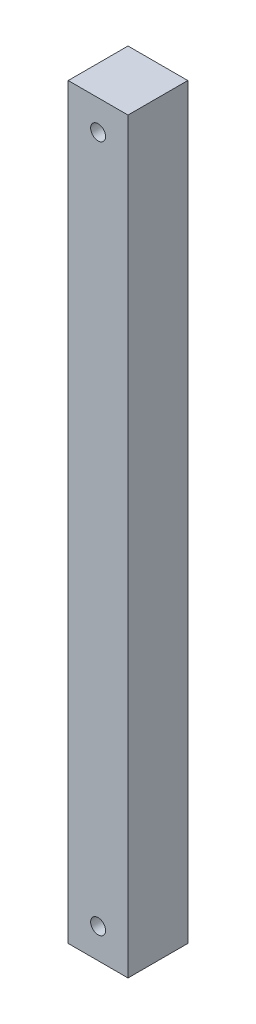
ISO-10303-21;
HEADER;
FILE_DESCRIPTION(('STEP AP214'),'2;1');
FILE_NAME('part.step','',(''),(''),'','','');
FILE_SCHEMA(('AUTOMOTIVE_DESIGN { 1 0 10303 214 1 1 1 1 }'));
ENDSEC;
DATA;
#1=APPLICATION_CONTEXT('core data for automotive mechanical design processes');
#2=APPLICATION_PROTOCOL_DEFINITION('international standard','automotive_design',2000,#1);
#3=PRODUCT_CONTEXT('',#1,'mechanical');
#4=PRODUCT('Part','Part','',(#3));
#5=PRODUCT_RELATED_PRODUCT_CATEGORY('part','',(#4));
#6=PRODUCT_DEFINITION_FORMATION('','',#4);
#7=PRODUCT_DEFINITION_CONTEXT('part definition',#1,'design');
#8=PRODUCT_DEFINITION('design','',#6,#7);
#9=PRODUCT_DEFINITION_SHAPE('','',#8);
#10=(LENGTH_UNIT() NAMED_UNIT(*) SI_UNIT(.MILLI.,.METRE.));
#11=(NAMED_UNIT(*) PLANE_ANGLE_UNIT() SI_UNIT($,.RADIAN.));
#12=(NAMED_UNIT(*) SI_UNIT($,.STERADIAN.) SOLID_ANGLE_UNIT());
#13=UNCERTAINTY_MEASURE_WITH_UNIT(LENGTH_MEASURE(1.E-05),#10,'distance_accuracy_value','');
#14=(GEOMETRIC_REPRESENTATION_CONTEXT(3) GLOBAL_UNCERTAINTY_ASSIGNED_CONTEXT((#13)) GLOBAL_UNIT_ASSIGNED_CONTEXT((#10,
#11,#12)) REPRESENTATION_CONTEXT('',''));
#15=CARTESIAN_POINT('',(0.,0.,0.));
#16=DIRECTION('',(0.,0.,1.));
#17=DIRECTION('',(1.,0.,0.));
#18=AXIS2_PLACEMENT_3D('',#15,#16,#17);
#19=CARTESIAN_POINT('',(0.,0.,2.));
#20=DIRECTION('',(0.,0.,1.));
#21=DIRECTION('',(1.,0.,0.));
#22=AXIS2_PLACEMENT_3D('',#19,#20,#21);
#23=PLANE('',#22);
#24=CARTESIAN_POINT('',(9.,24.,2.));
#25=DIRECTION('',(0.,0.,1.));
#26=DIRECTION('',(1.,0.,0.));
#27=AXIS2_PLACEMENT_3D('',#24,#25,#26);
#28=CIRCLE('',#27,0.25);
#29=CARTESIAN_POINT('',(9.25,24.,2.));
#30=VERTEX_POINT('',#29);
#31=EDGE_CURVE('E102',#30,#30,#28,.T.);
#32=ORIENTED_EDGE('',*,*,#31,.F.);
#33=EDGE_LOOP('',(#32));
#34=FACE_BOUND('',#33,.T.);
#35=DIRECTION('',(0.,1.,0.));
#36=VECTOR('',#35,1.);
#37=CARTESIAN_POINT('',(10.,0.,2.));
#38=LINE('',#37,#36);
#39=CARTESIAN_POINT('',(10.,0.,2.));
#40=VERTEX_POINT('',#39);
#41=CARTESIAN_POINT('',(10.,25.,2.));
#42=VERTEX_POINT('',#41);
#43=EDGE_CURVE('E87',#40,#42,#38,.T.);
#44=ORIENTED_EDGE('',*,*,#43,.T.);
#45=DIRECTION('',(-1.,0.,0.));
#46=VECTOR('',#45,1.);
#47=CARTESIAN_POINT('',(10.,25.,2.));
#48=LINE('',#47,#46);
#49=CARTESIAN_POINT('',(8.,25.,2.));
#50=VERTEX_POINT('',#49);
#51=EDGE_CURVE('E82',#42,#50,#48,.T.);
#52=ORIENTED_EDGE('',*,*,#51,.T.);
#53=DIRECTION('',(0.,-1.,0.));
#54=VECTOR('',#53,1.);
#55=CARTESIAN_POINT('',(8.,0.,2.));
#56=LINE('',#55,#54);
#57=CARTESIAN_POINT('',(8.,0.,2.));
#58=VERTEX_POINT('',#57);
#59=EDGE_CURVE('E85',#50,#58,#56,.T.);
#60=ORIENTED_EDGE('',*,*,#59,.T.);
#61=DIRECTION('',(1.,0.,0.));
#62=VECTOR('',#61,1.);
#63=CARTESIAN_POINT('',(10.,0.,2.));
#64=LINE('',#63,#62);
#65=EDGE_CURVE('E52',#58,#40,#64,.T.);
#66=ORIENTED_EDGE('',*,*,#65,.T.);
#67=EDGE_LOOP('',(#44,#52,#60,#66));
#68=FACE_BOUND('',#67,.T.);
#69=CARTESIAN_POINT('',(9.,1.00000000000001,2.));
#70=DIRECTION('',(0.,0.,1.));
#71=DIRECTION('',(1.,0.,0.));
#72=AXIS2_PLACEMENT_3D('',#69,#70,#71);
#73=CIRCLE('',#72,0.249999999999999);
#74=CARTESIAN_POINT('',(9.25,1.00000000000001,2.));
#75=VERTEX_POINT('',#74);
#76=EDGE_CURVE('E117',#75,#75,#73,.T.);
#77=ORIENTED_EDGE('',*,*,#76,.F.);
#78=EDGE_LOOP('',(#77));
#79=FACE_BOUND('',#78,.T.);
#80=ADVANCED_FACE('F35',(#34,#68,#79),#23,.T.);
#81=CARTESIAN_POINT('',(0.,0.,0.));
#82=DIRECTION('',(0.,0.,1.));
#83=DIRECTION('',(1.,0.,0.));
#84=AXIS2_PLACEMENT_3D('',#81,#82,#83);
#85=PLANE('',#84);
#86=DIRECTION('',(0.,1.,0.));
#87=VECTOR('',#86,1.);
#88=CARTESIAN_POINT('',(10.,0.,0.));
#89=LINE('',#88,#87);
#90=CARTESIAN_POINT('',(10.,0.,0.));
#91=VERTEX_POINT('',#90);
#92=CARTESIAN_POINT('',(10.,25.,0.));
#93=VERTEX_POINT('',#92);
#94=EDGE_CURVE('E99',#91,#93,#89,.T.);
#95=ORIENTED_EDGE('',*,*,#94,.F.);
#96=DIRECTION('',(1.,0.,0.));
#97=VECTOR('',#96,1.);
#98=CARTESIAN_POINT('',(10.,0.,0.));
#99=LINE('',#98,#97);
#100=CARTESIAN_POINT('',(8.,0.,0.));
#101=VERTEX_POINT('',#100);
#102=EDGE_CURVE('E75',#101,#91,#99,.T.);
#103=ORIENTED_EDGE('',*,*,#102,.F.);
#104=DIRECTION('',(0.,-1.,0.));
#105=VECTOR('',#104,1.);
#106=CARTESIAN_POINT('',(8.,0.,0.));
#107=LINE('',#106,#105);
#108=CARTESIAN_POINT('',(8.,25.,0.));
#109=VERTEX_POINT('',#108);
#110=EDGE_CURVE('E69',#109,#101,#107,.T.);
#111=ORIENTED_EDGE('',*,*,#110,.F.);
#112=DIRECTION('',(-1.,0.,0.));
#113=VECTOR('',#112,1.);
#114=CARTESIAN_POINT('',(10.,25.,0.));
#115=LINE('',#114,#113);
#116=EDGE_CURVE('E91',#93,#109,#115,.T.);
#117=ORIENTED_EDGE('',*,*,#116,.F.);
#118=EDGE_LOOP('',(#95,#103,#111,#117));
#119=FACE_BOUND('',#118,.T.);
#120=CARTESIAN_POINT('',(9.,24.,0.));
#121=DIRECTION('',(0.,0.,1.));
#122=DIRECTION('',(1.,0.,0.));
#123=AXIS2_PLACEMENT_3D('',#120,#121,#122);
#124=CIRCLE('',#123,0.25);
#125=CARTESIAN_POINT('',(9.25,24.,0.));
#126=VERTEX_POINT('',#125);
#127=EDGE_CURVE('E114',#126,#126,#124,.T.);
#128=ORIENTED_EDGE('',*,*,#127,.T.);
#129=EDGE_LOOP('',(#128));
#130=FACE_BOUND('',#129,.T.);
#131=CARTESIAN_POINT('',(9.,1.00000000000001,0.));
#132=DIRECTION('',(0.,0.,1.));
#133=DIRECTION('',(1.,0.,0.));
#134=AXIS2_PLACEMENT_3D('',#131,#132,#133);
#135=CIRCLE('',#134,0.249999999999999);
#136=CARTESIAN_POINT('',(9.25,1.00000000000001,0.));
#137=VERTEX_POINT('',#136);
#138=EDGE_CURVE('E120',#137,#137,#135,.T.);
#139=ORIENTED_EDGE('',*,*,#138,.T.);
#140=EDGE_LOOP('',(#139));
#141=FACE_BOUND('',#140,.T.);
#142=ADVANCED_FACE('F110',(#119,#130,#141),#85,.F.);
#143=CARTESIAN_POINT('',(10.,0.,2.));
#144=DIRECTION('',(-1.,0.,0.));
#145=DIRECTION('',(0.,0.,1.));
#146=AXIS2_PLACEMENT_3D('',#143,#144,#145);
#147=PLANE('',#146);
#148=ORIENTED_EDGE('',*,*,#94,.T.);
#149=DIRECTION('',(0.,0.,-1.));
#150=VECTOR('',#149,1.);
#151=CARTESIAN_POINT('',(10.,25.,2.));
#152=LINE('',#151,#150);
#153=EDGE_CURVE('E11',#42,#93,#152,.T.);
#154=ORIENTED_EDGE('',*,*,#153,.F.);
#155=ORIENTED_EDGE('',*,*,#43,.F.);
#156=DIRECTION('',(0.,0.,-1.));
#157=VECTOR('',#156,1.);
#158=CARTESIAN_POINT('',(10.,0.,2.));
#159=LINE('',#158,#157);
#160=EDGE_CURVE('E95',#40,#91,#159,.T.);
#161=ORIENTED_EDGE('',*,*,#160,.T.);
#162=EDGE_LOOP('',(#148,#154,#155,#161));
#163=FACE_BOUND('',#162,.T.);
#164=ADVANCED_FACE('F37',(#163),#147,.F.);
#165=CARTESIAN_POINT('',(10.,25.,2.));
#166=DIRECTION('',(0.,-1.,0.));
#167=DIRECTION('',(0.,0.,-1.));
#168=AXIS2_PLACEMENT_3D('',#165,#166,#167);
#169=PLANE('',#168);
#170=ORIENTED_EDGE('',*,*,#116,.T.);
#171=DIRECTION('',(0.,0.,-1.));
#172=VECTOR('',#171,1.);
#173=CARTESIAN_POINT('',(8.,25.,2.));
#174=LINE('',#173,#172);
#175=EDGE_CURVE('E44',#50,#109,#174,.T.);
#176=ORIENTED_EDGE('',*,*,#175,.F.);
#177=ORIENTED_EDGE('',*,*,#51,.F.);
#178=ORIENTED_EDGE('',*,*,#153,.T.);
#179=EDGE_LOOP('',(#170,#176,#177,#178));
#180=FACE_BOUND('',#179,.T.);
#181=ADVANCED_FACE('F90',(#180),#169,.F.);
#182=CARTESIAN_POINT('',(8.,0.,2.));
#183=DIRECTION('',(1.,0.,0.));
#184=DIRECTION('',(0.,0.,-1.));
#185=AXIS2_PLACEMENT_3D('',#182,#183,#184);
#186=PLANE('',#185);
#187=ORIENTED_EDGE('',*,*,#110,.T.);
#188=DIRECTION('',(0.,0.,-1.));
#189=VECTOR('',#188,1.);
#190=CARTESIAN_POINT('',(8.,0.,2.));
#191=LINE('',#190,#189);
#192=EDGE_CURVE('E92',#58,#101,#191,.T.);
#193=ORIENTED_EDGE('',*,*,#192,.F.);
#194=ORIENTED_EDGE('',*,*,#59,.F.);
#195=ORIENTED_EDGE('',*,*,#175,.T.);
#196=EDGE_LOOP('',(#187,#193,#194,#195));
#197=FACE_BOUND('',#196,.T.);
#198=ADVANCED_FACE('F93',(#197),#186,.F.);
#199=CARTESIAN_POINT('',(10.,0.,2.));
#200=DIRECTION('',(0.,1.,0.));
#201=DIRECTION('',(-1.,0.,0.));
#202=AXIS2_PLACEMENT_3D('',#199,#200,#201);
#203=PLANE('',#202);
#204=ORIENTED_EDGE('',*,*,#102,.T.);
#205=ORIENTED_EDGE('',*,*,#160,.F.);
#206=ORIENTED_EDGE('',*,*,#65,.F.);
#207=ORIENTED_EDGE('',*,*,#192,.T.);
#208=EDGE_LOOP('',(#204,#205,#206,#207));
#209=FACE_BOUND('',#208,.T.);
#210=ADVANCED_FACE('F107',(#209),#203,.F.);
#211=CARTESIAN_POINT('',(9.,24.,2.));
#212=DIRECTION('',(0.,0.,-1.));
#213=DIRECTION('',(-1.,0.,0.));
#214=AXIS2_PLACEMENT_3D('',#211,#212,#213);
#215=CYLINDRICAL_SURFACE('',#214,0.25);
#216=ORIENTED_EDGE('',*,*,#31,.T.);
#217=EDGE_LOOP('',(#216));
#218=FACE_BOUND('',#217,.T.);
#219=ORIENTED_EDGE('',*,*,#127,.F.);
#220=EDGE_LOOP('',(#219));
#221=FACE_BOUND('',#220,.T.);
#222=ADVANCED_FACE('F137',(#218,#221),#215,.F.);
#223=CARTESIAN_POINT('',(9.,1.00000000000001,2.));
#224=DIRECTION('',(0.,0.,-1.));
#225=DIRECTION('',(-1.,0.,0.));
#226=AXIS2_PLACEMENT_3D('',#223,#224,#225);
#227=CYLINDRICAL_SURFACE('',#226,0.249999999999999);
#228=ORIENTED_EDGE('',*,*,#76,.T.);
#229=EDGE_LOOP('',(#228));
#230=FACE_BOUND('',#229,.T.);
#231=ORIENTED_EDGE('',*,*,#138,.F.);
#232=EDGE_LOOP('',(#231));
#233=FACE_BOUND('',#232,.T.);
#234=ADVANCED_FACE('F126',(#230,#233),#227,.F.);
#235=CLOSED_SHELL('',(#80,#142,#164,#181,#198,#210,#222,#234));
#236=MANIFOLD_SOLID_BREP('B2',#235);
#237=ADVANCED_BREP_SHAPE_REPRESENTATION('',(#18,#236),#14);
#238=SHAPE_DEFINITION_REPRESENTATION(#9,#237);
ENDSEC;
END-ISO-10303-21;
